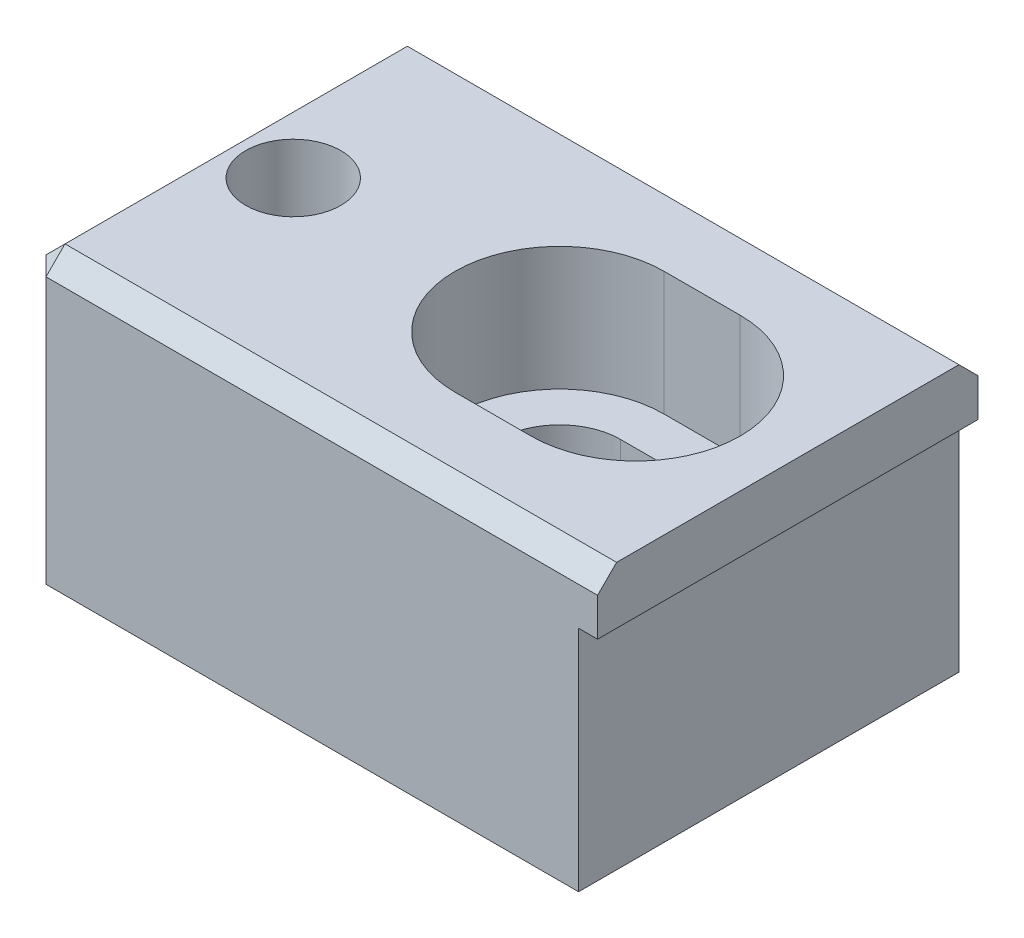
ISO-10303-21;
HEADER;
FILE_DESCRIPTION(('STEP AP214'),'2;1');
FILE_NAME('part.step','',(''),(''),'','','');
FILE_SCHEMA(('AUTOMOTIVE_DESIGN { 1 0 10303 214 1 1 1 1 }'));
ENDSEC;
DATA;
#1=APPLICATION_CONTEXT('core data for automotive mechanical design processes');
#2=APPLICATION_PROTOCOL_DEFINITION('international standard','automotive_design',2000,#1);
#3=PRODUCT_CONTEXT('',#1,'mechanical');
#4=PRODUCT('Part','Part','',(#3));
#5=PRODUCT_RELATED_PRODUCT_CATEGORY('part','',(#4));
#6=PRODUCT_DEFINITION_FORMATION('','',#4);
#7=PRODUCT_DEFINITION_CONTEXT('part definition',#1,'design');
#8=PRODUCT_DEFINITION('design','',#6,#7);
#9=PRODUCT_DEFINITION_SHAPE('','',#8);
#10=(LENGTH_UNIT() NAMED_UNIT(*) SI_UNIT(.MILLI.,.METRE.));
#11=(NAMED_UNIT(*) PLANE_ANGLE_UNIT() SI_UNIT($,.RADIAN.));
#12=(NAMED_UNIT(*) SI_UNIT($,.STERADIAN.) SOLID_ANGLE_UNIT());
#13=UNCERTAINTY_MEASURE_WITH_UNIT(LENGTH_MEASURE(1.E-05),#10,'distance_accuracy_value','');
#14=(GEOMETRIC_REPRESENTATION_CONTEXT(3) GLOBAL_UNCERTAINTY_ASSIGNED_CONTEXT((#13)) GLOBAL_UNIT_ASSIGNED_CONTEXT((#10,
#11,#12)) REPRESENTATION_CONTEXT('',''));
#15=CARTESIAN_POINT('',(0.,0.,0.));
#16=DIRECTION('',(0.,0.,1.));
#17=DIRECTION('',(1.,0.,0.));
#18=AXIS2_PLACEMENT_3D('',#15,#16,#17);
#19=CARTESIAN_POINT('',(-27.6,25.,10.));
#20=DIRECTION('',(1.,0.,0.));
#21=DIRECTION('',(0.,1.,0.));
#22=AXIS2_PLACEMENT_3D('',#19,#20,#21);
#23=PLANE('',#22);
#24=DIRECTION('',(0.,0.,-1.));
#25=VECTOR('',#24,1.);
#26=CARTESIAN_POINT('',(-27.6,10.,10.));
#27=LINE('',#26,#25);
#28=CARTESIAN_POINT('',(-27.6,10.,9.));
#29=VERTEX_POINT('',#28);
#30=CARTESIAN_POINT('',(-27.6,10.,-9.));
#31=VERTEX_POINT('',#30);
#32=EDGE_CURVE('E270',#29,#31,#27,.T.);
#33=ORIENTED_EDGE('',*,*,#32,.F.);
#34=DIRECTION('',(0.,1.,0.));
#35=VECTOR('',#34,1.);
#36=CARTESIAN_POINT('',(-27.6,25.,9.));
#37=LINE('',#36,#35);
#38=CARTESIAN_POINT('',(-27.6,24.,9.));
#39=VERTEX_POINT('',#38);
#40=EDGE_CURVE('E11',#29,#39,#37,.T.);
#41=ORIENTED_EDGE('',*,*,#40,.T.);
#42=DIRECTION('',(0.,0.,-1.));
#43=VECTOR('',#42,1.);
#44=CARTESIAN_POINT('',(-27.6,24.,10.));
#45=LINE('',#44,#43);
#46=CARTESIAN_POINT('',(-27.6,24.,-9.));
#47=VERTEX_POINT('',#46);
#48=EDGE_CURVE('E48',#39,#47,#45,.T.);
#49=ORIENTED_EDGE('',*,*,#48,.T.);
#50=DIRECTION('',(0.,-1.,0.));
#51=VECTOR('',#50,1.);
#52=CARTESIAN_POINT('',(-27.6,25.,-9.));
#53=LINE('',#52,#51);
#54=EDGE_CURVE('E296',#47,#31,#53,.T.);
#55=ORIENTED_EDGE('',*,*,#54,.T.);
#56=EDGE_LOOP('',(#33,#41,#49,#55));
#57=FACE_BOUND('',#56,.T.);
#58=ADVANCED_FACE('F39',(#57),#23,.F.);
#59=CARTESIAN_POINT('',(-27.6,10.,10.));
#60=DIRECTION('',(0.,1.,0.));
#61=DIRECTION('',(0.,0.,1.));
#62=AXIS2_PLACEMENT_3D('',#59,#60,#61);
#63=PLANE('',#62);
#64=DIRECTION('',(-1.,0.,0.));
#65=VECTOR('',#64,1.);
#66=CARTESIAN_POINT('',(-9.6,10.,-3.2));
#67=LINE('',#66,#65);
#68=CARTESIAN_POINT('',(-5.6,10.,-3.2));
#69=VERTEX_POINT('',#68);
#70=CARTESIAN_POINT('',(-9.6,10.,-3.2));
#71=VERTEX_POINT('',#70);
#72=EDGE_CURVE('E173',#69,#71,#67,.T.);
#73=ORIENTED_EDGE('',*,*,#72,.T.);
#74=CARTESIAN_POINT('',(-9.6,10.,0.));
#75=DIRECTION('',(0.,1.,0.));
#76=DIRECTION('',(0.,0.,1.));
#77=AXIS2_PLACEMENT_3D('',#74,#75,#76);
#78=CIRCLE('',#77,3.2);
#79=CARTESIAN_POINT('',(-9.6,10.,3.2));
#80=VERTEX_POINT('',#79);
#81=EDGE_CURVE('E167',#71,#80,#78,.T.);
#82=ORIENTED_EDGE('',*,*,#81,.T.);
#83=DIRECTION('',(1.,0.,0.));
#84=VECTOR('',#83,1.);
#85=CARTESIAN_POINT('',(-9.6,10.,3.2));
#86=LINE('',#85,#84);
#87=CARTESIAN_POINT('',(-5.6,10.,3.2));
#88=VERTEX_POINT('',#87);
#89=EDGE_CURVE('E176',#80,#88,#86,.T.);
#90=ORIENTED_EDGE('',*,*,#89,.T.);
#91=CARTESIAN_POINT('',(-5.6,10.,0.));
#92=DIRECTION('',(0.,1.,0.));
#93=DIRECTION('',(0.,0.,1.));
#94=AXIS2_PLACEMENT_3D('',#91,#92,#93);
#95=CIRCLE('',#94,3.2);
#96=EDGE_CURVE('E56',#88,#69,#95,.T.);
#97=ORIENTED_EDGE('',*,*,#96,.T.);
#98=EDGE_LOOP('',(#73,#82,#90,#97));
#99=FACE_BOUND('',#98,.T.);
#100=CARTESIAN_POINT('',(-23.6,10.,0.));
#101=DIRECTION('',(0.,1.,0.));
#102=DIRECTION('',(0.,0.,1.));
#103=AXIS2_PLACEMENT_3D('',#100,#101,#102);
#104=CIRCLE('',#103,2.5);
#105=CARTESIAN_POINT('',(-23.6,10.,2.5));
#106=VERTEX_POINT('',#105);
#107=EDGE_CURVE('E236',#106,#106,#104,.T.);
#108=ORIENTED_EDGE('',*,*,#107,.T.);
#109=EDGE_LOOP('',(#108));
#110=FACE_BOUND('',#109,.T.);
#111=DIRECTION('',(1.,0.,0.));
#112=VECTOR('',#111,1.);
#113=CARTESIAN_POINT('',(-27.6,10.,10.));
#114=LINE('',#113,#112);
#115=CARTESIAN_POINT('',(-26.6,10.,10.));
#116=VERTEX_POINT('',#115);
#117=CARTESIAN_POINT('',(1.4,10.,10.));
#118=VERTEX_POINT('',#117);
#119=EDGE_CURVE('E240',#116,#118,#114,.T.);
#120=ORIENTED_EDGE('',*,*,#119,.F.);
#121=DIRECTION('',(-0.707106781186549,0.,-0.707106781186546));
#122=VECTOR('',#121,1.);
#123=CARTESIAN_POINT('',(-26.6,10.,10.));
#124=LINE('',#123,#122);
#125=EDGE_CURVE('E294',#116,#29,#124,.T.);
#126=ORIENTED_EDGE('',*,*,#125,.T.);
#127=ORIENTED_EDGE('',*,*,#32,.T.);
#128=DIRECTION('',(-0.707106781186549,0.,0.707106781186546));
#129=VECTOR('',#128,1.);
#130=CARTESIAN_POINT('',(-27.6,10.,-9.));
#131=LINE('',#130,#129);
#132=CARTESIAN_POINT('',(-26.6,10.,-10.));
#133=VERTEX_POINT('',#132);
#134=EDGE_CURVE('E292',#31,#133,#131,.F.);
#135=ORIENTED_EDGE('',*,*,#134,.T.);
#136=DIRECTION('',(1.,0.,0.));
#137=VECTOR('',#136,1.);
#138=CARTESIAN_POINT('',(-27.6,10.,-10.));
#139=LINE('',#138,#137);
#140=CARTESIAN_POINT('',(1.4,10.,-10.));
#141=VERTEX_POINT('',#140);
#142=EDGE_CURVE('E251',#133,#141,#139,.T.);
#143=ORIENTED_EDGE('',*,*,#142,.T.);
#144=DIRECTION('',(0.,0.,-1.));
#145=VECTOR('',#144,1.);
#146=CARTESIAN_POINT('',(1.4,10.,10.));
#147=LINE('',#146,#145);
#148=EDGE_CURVE('E267',#118,#141,#147,.T.);
#149=ORIENTED_EDGE('',*,*,#148,.F.);
#150=EDGE_LOOP('',(#120,#126,#127,#135,#143,#149));
#151=FACE_BOUND('',#150,.T.);
#152=ADVANCED_FACE('F180',(#99,#110,#151),#63,.F.);
#153=CARTESIAN_POINT('',(1.4,22.,10.));
#154=DIRECTION('',(-1.,0.,0.));
#155=DIRECTION('',(0.,-1.,0.));
#156=AXIS2_PLACEMENT_3D('',#153,#154,#155);
#157=PLANE('',#156);
#158=DIRECTION('',(0.,1.,0.));
#159=VECTOR('',#158,1.);
#160=CARTESIAN_POINT('',(1.4,22.,-10.));
#161=LINE('',#160,#159);
#162=CARTESIAN_POINT('',(1.4,22.,-10.));
#163=VERTEX_POINT('',#162);
#164=EDGE_CURVE('E253',#141,#163,#161,.T.);
#165=ORIENTED_EDGE('',*,*,#164,.T.);
#166=DIRECTION('',(0.,0.,-1.));
#167=VECTOR('',#166,1.);
#168=CARTESIAN_POINT('',(1.4,22.,10.));
#169=LINE('',#168,#167);
#170=CARTESIAN_POINT('',(1.4,22.,10.));
#171=VERTEX_POINT('',#170);
#172=EDGE_CURVE('E264',#171,#163,#169,.T.);
#173=ORIENTED_EDGE('',*,*,#172,.F.);
#174=DIRECTION('',(0.,1.,0.));
#175=VECTOR('',#174,1.);
#176=CARTESIAN_POINT('',(1.4,22.,10.));
#177=LINE('',#176,#175);
#178=EDGE_CURVE('E242',#118,#171,#177,.T.);
#179=ORIENTED_EDGE('',*,*,#178,.F.);
#180=ORIENTED_EDGE('',*,*,#148,.T.);
#181=EDGE_LOOP('',(#165,#173,#179,#180));
#182=FACE_BOUND('',#181,.T.);
#183=ADVANCED_FACE('F349',(#182),#157,.F.);
#184=CARTESIAN_POINT('',(2.4,22.,10.));
#185=DIRECTION('',(0.,1.,0.));
#186=DIRECTION('',(0.,0.,1.));
#187=AXIS2_PLACEMENT_3D('',#184,#185,#186);
#188=PLANE('',#187);
#189=DIRECTION('',(1.,0.,0.));
#190=VECTOR('',#189,1.);
#191=CARTESIAN_POINT('',(2.4,22.,-10.));
#192=LINE('',#191,#190);
#193=CARTESIAN_POINT('',(2.4,22.,-10.));
#194=VERTEX_POINT('',#193);
#195=EDGE_CURVE('E255',#163,#194,#192,.T.);
#196=ORIENTED_EDGE('',*,*,#195,.T.);
#197=DIRECTION('',(0.,0.,-1.));
#198=VECTOR('',#197,1.);
#199=CARTESIAN_POINT('',(2.4,22.,10.));
#200=LINE('',#199,#198);
#201=CARTESIAN_POINT('',(2.4,22.,10.));
#202=VERTEX_POINT('',#201);
#203=EDGE_CURVE('E261',#202,#194,#200,.T.);
#204=ORIENTED_EDGE('',*,*,#203,.F.);
#205=DIRECTION('',(1.,0.,0.));
#206=VECTOR('',#205,1.);
#207=CARTESIAN_POINT('',(2.4,22.,10.));
#208=LINE('',#207,#206);
#209=EDGE_CURVE('E245',#171,#202,#208,.T.);
#210=ORIENTED_EDGE('',*,*,#209,.F.);
#211=ORIENTED_EDGE('',*,*,#172,.T.);
#212=EDGE_LOOP('',(#196,#204,#210,#211));
#213=FACE_BOUND('',#212,.T.);
#214=ADVANCED_FACE('F345',(#213),#188,.F.);
#215=CARTESIAN_POINT('',(2.4,25.,10.));
#216=DIRECTION('',(-1.,0.,0.));
#217=DIRECTION('',(0.,0.,1.));
#218=AXIS2_PLACEMENT_3D('',#215,#216,#217);
#219=PLANE('',#218);
#220=DIRECTION('',(0.,0.,-1.));
#221=VECTOR('',#220,1.);
#222=CARTESIAN_POINT('',(2.4,25.,10.));
#223=LINE('',#222,#221);
#224=CARTESIAN_POINT('',(2.4,25.,9.));
#225=VERTEX_POINT('',#224);
#226=CARTESIAN_POINT('',(2.4,25.,-9.));
#227=VERTEX_POINT('',#226);
#228=EDGE_CURVE('E250',#225,#227,#223,.T.);
#229=ORIENTED_EDGE('',*,*,#228,.F.);
#230=DIRECTION('',(0.,-0.707106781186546,0.707106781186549));
#231=VECTOR('',#230,1.);
#232=CARTESIAN_POINT('',(2.4,24.,10.));
#233=LINE('',#232,#231);
#234=CARTESIAN_POINT('',(2.4,24.,10.));
#235=VERTEX_POINT('',#234);
#236=EDGE_CURVE('E286',#225,#235,#233,.T.);
#237=ORIENTED_EDGE('',*,*,#236,.T.);
#238=DIRECTION('',(0.,1.,0.));
#239=VECTOR('',#238,1.);
#240=CARTESIAN_POINT('',(2.4,25.,10.));
#241=LINE('',#240,#239);
#242=EDGE_CURVE('E247',#202,#235,#241,.T.);
#243=ORIENTED_EDGE('',*,*,#242,.F.);
#244=ORIENTED_EDGE('',*,*,#203,.T.);
#245=DIRECTION('',(0.,1.,0.));
#246=VECTOR('',#245,1.);
#247=CARTESIAN_POINT('',(2.4,25.,-10.));
#248=LINE('',#247,#246);
#249=CARTESIAN_POINT('',(2.4,24.,-10.));
#250=VERTEX_POINT('',#249);
#251=EDGE_CURVE('E243',#194,#250,#248,.T.);
#252=ORIENTED_EDGE('',*,*,#251,.T.);
#253=DIRECTION('',(0.,-0.707106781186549,-0.707106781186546));
#254=VECTOR('',#253,1.);
#255=CARTESIAN_POINT('',(2.4,25.,-9.));
#256=LINE('',#255,#254);
#257=EDGE_CURVE('E284',#250,#227,#256,.F.);
#258=ORIENTED_EDGE('',*,*,#257,.T.);
#259=EDGE_LOOP('',(#229,#237,#243,#244,#252,#258));
#260=FACE_BOUND('',#259,.T.);
#261=ADVANCED_FACE('F340',(#260),#219,.F.);
#262=CARTESIAN_POINT('',(-27.6,25.,10.));
#263=DIRECTION('',(0.,-1.,0.));
#264=DIRECTION('',(0.,0.,-1.));
#265=AXIS2_PLACEMENT_3D('',#262,#263,#264);
#266=PLANE('',#265);
#267=DIRECTION('',(1.,0.,0.));
#268=VECTOR('',#267,1.);
#269=CARTESIAN_POINT('',(-9.6,25.,5.5));
#270=LINE('',#269,#268);
#271=CARTESIAN_POINT('',(-9.59999999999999,25.,5.5));
#272=VERTEX_POINT('',#271);
#273=CARTESIAN_POINT('',(-5.6,25.,5.5));
#274=VERTEX_POINT('',#273);
#275=EDGE_CURVE('E217',#272,#274,#270,.T.);
#276=ORIENTED_EDGE('',*,*,#275,.F.);
#277=CARTESIAN_POINT('',(-9.6,25.,0.));
#278=DIRECTION('',(0.,1.,0.));
#279=DIRECTION('',(0.,0.,1.));
#280=AXIS2_PLACEMENT_3D('',#277,#278,#279);
#281=CIRCLE('',#280,5.5);
#282=CARTESIAN_POINT('',(-9.6,25.,-5.5));
#283=VERTEX_POINT('',#282);
#284=EDGE_CURVE('E198',#283,#272,#281,.T.);
#285=ORIENTED_EDGE('',*,*,#284,.F.);
#286=DIRECTION('',(-1.,0.,0.));
#287=VECTOR('',#286,1.);
#288=CARTESIAN_POINT('',(-9.6,25.,-5.5));
#289=LINE('',#288,#287);
#290=CARTESIAN_POINT('',(-5.6,25.,-5.5));
#291=VERTEX_POINT('',#290);
#292=EDGE_CURVE('E206',#291,#283,#289,.T.);
#293=ORIENTED_EDGE('',*,*,#292,.F.);
#294=CARTESIAN_POINT('',(-5.6,25.,0.));
#295=DIRECTION('',(0.,1.,0.));
#296=DIRECTION('',(0.,0.,1.));
#297=AXIS2_PLACEMENT_3D('',#294,#295,#296);
#298=CIRCLE('',#297,5.5);
#299=EDGE_CURVE('E220',#274,#291,#298,.T.);
#300=ORIENTED_EDGE('',*,*,#299,.F.);
#301=EDGE_LOOP('',(#276,#285,#293,#300));
#302=FACE_BOUND('',#301,.T.);
#303=CARTESIAN_POINT('',(-23.6,25.,0.));
#304=DIRECTION('',(0.,1.,0.));
#305=DIRECTION('',(0.,0.,1.));
#306=AXIS2_PLACEMENT_3D('',#303,#304,#305);
#307=CIRCLE('',#306,2.49999999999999);
#308=CARTESIAN_POINT('',(-23.6,25.,2.49999999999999));
#309=VERTEX_POINT('',#308);
#310=EDGE_CURVE('E227',#309,#309,#307,.T.);
#311=ORIENTED_EDGE('',*,*,#310,.F.);
#312=EDGE_LOOP('',(#311));
#313=FACE_BOUND('',#312,.T.);
#314=DIRECTION('',(0.,0.,1.));
#315=VECTOR('',#314,1.);
#316=CARTESIAN_POINT('',(-26.6,25.,10.));
#317=LINE('',#316,#315);
#318=CARTESIAN_POINT('',(-26.6,25.,-9.));
#319=VERTEX_POINT('',#318);
#320=CARTESIAN_POINT('',(-26.6,25.,9.));
#321=VERTEX_POINT('',#320);
#322=EDGE_CURVE('E278',#319,#321,#317,.T.);
#323=ORIENTED_EDGE('',*,*,#322,.T.);
#324=DIRECTION('',(1.,0.,0.));
#325=VECTOR('',#324,1.);
#326=CARTESIAN_POINT('',(2.4,25.,9.));
#327=LINE('',#326,#325);
#328=EDGE_CURVE('E282',#321,#225,#327,.T.);
#329=ORIENTED_EDGE('',*,*,#328,.T.);
#330=ORIENTED_EDGE('',*,*,#228,.T.);
#331=DIRECTION('',(-1.,0.,0.));
#332=VECTOR('',#331,1.);
#333=CARTESIAN_POINT('',(-27.6,25.,-9.));
#334=LINE('',#333,#332);
#335=EDGE_CURVE('E280',#227,#319,#334,.T.);
#336=ORIENTED_EDGE('',*,*,#335,.T.);
#337=EDGE_LOOP('',(#323,#329,#330,#336));
#338=FACE_BOUND('',#337,.T.);
#339=ADVANCED_FACE('F327',(#302,#313,#338),#266,.F.);
#340=CARTESIAN_POINT('',(0.,0.,10.));
#341=DIRECTION('',(0.,0.,1.));
#342=DIRECTION('',(1.,0.,0.));
#343=AXIS2_PLACEMENT_3D('',#340,#341,#342);
#344=PLANE('',#343);
#345=ORIENTED_EDGE('',*,*,#242,.T.);
#346=DIRECTION('',(-1.,0.,0.));
#347=VECTOR('',#346,1.);
#348=CARTESIAN_POINT('',(-27.6,24.,10.));
#349=LINE('',#348,#347);
#350=CARTESIAN_POINT('',(-26.6,24.,10.));
#351=VERTEX_POINT('',#350);
#352=EDGE_CURVE('E275',#235,#351,#349,.T.);
#353=ORIENTED_EDGE('',*,*,#352,.T.);
#354=DIRECTION('',(0.,-1.,0.));
#355=VECTOR('',#354,1.);
#356=CARTESIAN_POINT('',(-26.6,10.,10.));
#357=LINE('',#356,#355);
#358=EDGE_CURVE('E273',#351,#116,#357,.T.);
#359=ORIENTED_EDGE('',*,*,#358,.T.);
#360=ORIENTED_EDGE('',*,*,#119,.T.);
#361=ORIENTED_EDGE('',*,*,#178,.T.);
#362=ORIENTED_EDGE('',*,*,#209,.T.);
#363=EDGE_LOOP('',(#345,#353,#359,#360,#361,#362));
#364=FACE_BOUND('',#363,.T.);
#365=ADVANCED_FACE('F370',(#364),#344,.T.);
#366=CARTESIAN_POINT('',(0.,0.,-10.));
#367=DIRECTION('',(0.,0.,1.));
#368=DIRECTION('',(1.,0.,0.));
#369=AXIS2_PLACEMENT_3D('',#366,#367,#368);
#370=PLANE('',#369);
#371=DIRECTION('',(0.,1.,0.));
#372=VECTOR('',#371,1.);
#373=CARTESIAN_POINT('',(-26.6,0.,-10.));
#374=LINE('',#373,#372);
#375=CARTESIAN_POINT('',(-26.6,24.,-10.));
#376=VERTEX_POINT('',#375);
#377=EDGE_CURVE('E288',#133,#376,#374,.T.);
#378=ORIENTED_EDGE('',*,*,#377,.T.);
#379=DIRECTION('',(1.,0.,0.));
#380=VECTOR('',#379,1.);
#381=CARTESIAN_POINT('',(0.,24.,-10.));
#382=LINE('',#381,#380);
#383=EDGE_CURVE('E290',#376,#250,#382,.T.);
#384=ORIENTED_EDGE('',*,*,#383,.T.);
#385=ORIENTED_EDGE('',*,*,#251,.F.);
#386=ORIENTED_EDGE('',*,*,#195,.F.);
#387=ORIENTED_EDGE('',*,*,#164,.F.);
#388=ORIENTED_EDGE('',*,*,#142,.F.);
#389=EDGE_LOOP('',(#378,#384,#385,#386,#387,#388));
#390=FACE_BOUND('',#389,.T.);
#391=ADVANCED_FACE('F336',(#390),#370,.F.);
#392=CARTESIAN_POINT('',(-27.6,25.,-9.));
#393=DIRECTION('',(0.707106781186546,0.,0.707106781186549));
#394=DIRECTION('',(0.,-1.,0.));
#395=AXIS2_PLACEMENT_3D('',#392,#393,#394);
#396=PLANE('',#395);
#397=ORIENTED_EDGE('',*,*,#134,.F.);
#398=ORIENTED_EDGE('',*,*,#54,.F.);
#399=DIRECTION('',(0.707106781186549,0.,-0.707106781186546));
#400=VECTOR('',#399,1.);
#401=CARTESIAN_POINT('',(-27.1,24.,-9.5));
#402=LINE('',#401,#400);
#403=EDGE_CURVE('E43',#376,#47,#402,.F.);
#404=ORIENTED_EDGE('',*,*,#403,.F.);
#405=ORIENTED_EDGE('',*,*,#377,.F.);
#406=EDGE_LOOP('',(#397,#398,#404,#405));
#407=FACE_BOUND('',#406,.T.);
#408=ADVANCED_FACE('F41',(#407),#396,.F.);
#409=CARTESIAN_POINT('',(-27.6,25.,-9.));
#410=DIRECTION('',(0.,-0.707106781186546,0.707106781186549));
#411=DIRECTION('',(-1.,0.,0.));
#412=AXIS2_PLACEMENT_3D('',#409,#410,#411);
#413=PLANE('',#412);
#414=ORIENTED_EDGE('',*,*,#257,.F.);
#415=ORIENTED_EDGE('',*,*,#383,.F.);
#416=DIRECTION('',(0.,0.707106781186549,0.707106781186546));
#417=VECTOR('',#416,1.);
#418=CARTESIAN_POINT('',(-26.6,25.,-9.));
#419=LINE('',#418,#417);
#420=EDGE_CURVE('E308',#319,#376,#419,.F.);
#421=ORIENTED_EDGE('',*,*,#420,.F.);
#422=ORIENTED_EDGE('',*,*,#335,.F.);
#423=EDGE_LOOP('',(#414,#415,#421,#422));
#424=FACE_BOUND('',#423,.T.);
#425=ADVANCED_FACE('F333',(#424),#413,.F.);
#426=CARTESIAN_POINT('',(-26.6,25.,-9.));
#427=DIRECTION('',(-0.577350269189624,0.577350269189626,-0.577350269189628));
#428=DIRECTION('',(0.,0.707106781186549,0.707106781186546));
#429=AXIS2_PLACEMENT_3D('',#426,#427,#428);
#430=PLANE('',#429);
#431=ORIENTED_EDGE('',*,*,#420,.T.);
#432=ORIENTED_EDGE('',*,*,#403,.T.);
#433=DIRECTION('',(-0.707106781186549,-0.707106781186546,0.));
#434=VECTOR('',#433,1.);
#435=CARTESIAN_POINT('',(-26.6,25.,-9.));
#436=LINE('',#435,#434);
#437=EDGE_CURVE('E306',#319,#47,#436,.T.);
#438=ORIENTED_EDGE('',*,*,#437,.F.);
#439=EDGE_LOOP('',(#431,#432,#438));
#440=FACE_BOUND('',#439,.T.);
#441=ADVANCED_FACE('F315',(#440),#430,.T.);
#442=CARTESIAN_POINT('',(-26.6,0.,10.));
#443=DIRECTION('',(-0.707106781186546,0.,0.707106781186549));
#444=DIRECTION('',(0.,1.,0.));
#445=AXIS2_PLACEMENT_3D('',#442,#443,#444);
#446=PLANE('',#445);
#447=ORIENTED_EDGE('',*,*,#125,.F.);
#448=ORIENTED_EDGE('',*,*,#358,.F.);
#449=DIRECTION('',(0.707106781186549,0.,0.707106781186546));
#450=VECTOR('',#449,1.);
#451=CARTESIAN_POINT('',(-26.6,24.,10.));
#452=LINE('',#451,#450);
#453=EDGE_CURVE('E303',#39,#351,#452,.T.);
#454=ORIENTED_EDGE('',*,*,#453,.F.);
#455=ORIENTED_EDGE('',*,*,#40,.F.);
#456=EDGE_LOOP('',(#447,#448,#454,#455));
#457=FACE_BOUND('',#456,.T.);
#458=ADVANCED_FACE('F360',(#457),#446,.T.);
#459=CARTESIAN_POINT('',(-27.6,24.,10.));
#460=DIRECTION('',(0.707106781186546,-0.707106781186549,0.));
#461=DIRECTION('',(0.,0.,-1.));
#462=AXIS2_PLACEMENT_3D('',#459,#460,#461);
#463=PLANE('',#462);
#464=ORIENTED_EDGE('',*,*,#437,.T.);
#465=ORIENTED_EDGE('',*,*,#48,.F.);
#466=DIRECTION('',(0.707106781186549,0.707106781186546,0.));
#467=VECTOR('',#466,1.);
#468=CARTESIAN_POINT('',(-27.1,24.5,9.));
#469=LINE('',#468,#467);
#470=EDGE_CURVE('E300',#321,#39,#469,.F.);
#471=ORIENTED_EDGE('',*,*,#470,.F.);
#472=ORIENTED_EDGE('',*,*,#322,.F.);
#473=EDGE_LOOP('',(#464,#465,#471,#472));
#474=FACE_BOUND('',#473,.T.);
#475=ADVANCED_FACE('F322',(#474),#463,.F.);
#476=CARTESIAN_POINT('',(-26.6,24.,10.));
#477=DIRECTION('',(-0.577350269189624,0.577350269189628,0.577350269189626));
#478=DIRECTION('',(0.,-0.707106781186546,0.707106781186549));
#479=AXIS2_PLACEMENT_3D('',#476,#477,#478);
#480=PLANE('',#479);
#481=ORIENTED_EDGE('',*,*,#470,.T.);
#482=ORIENTED_EDGE('',*,*,#453,.T.);
#483=DIRECTION('',(0.,0.707106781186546,-0.707106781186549));
#484=VECTOR('',#483,1.);
#485=CARTESIAN_POINT('',(-26.6,24.,10.));
#486=LINE('',#485,#484);
#487=EDGE_CURVE('E239',#321,#351,#486,.F.);
#488=ORIENTED_EDGE('',*,*,#487,.F.);
#489=EDGE_LOOP('',(#481,#482,#488));
#490=FACE_BOUND('',#489,.T.);
#491=ADVANCED_FACE('F364',(#490),#480,.T.);
#492=CARTESIAN_POINT('',(0.,24.,10.));
#493=DIRECTION('',(0.,0.707106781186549,0.707106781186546));
#494=DIRECTION('',(1.,0.,0.));
#495=AXIS2_PLACEMENT_3D('',#492,#493,#494);
#496=PLANE('',#495);
#497=ORIENTED_EDGE('',*,*,#236,.F.);
#498=ORIENTED_EDGE('',*,*,#328,.F.);
#499=ORIENTED_EDGE('',*,*,#487,.T.);
#500=ORIENTED_EDGE('',*,*,#352,.F.);
#501=EDGE_LOOP('',(#497,#498,#499,#500));
#502=FACE_BOUND('',#501,.T.);
#503=ADVANCED_FACE('F368',(#502),#496,.T.);
#504=CARTESIAN_POINT('',(-23.6,25.,0.));
#505=DIRECTION('',(0.,1.,0.));
#506=DIRECTION('',(0.,0.,1.));
#507=AXIS2_PLACEMENT_3D('',#504,#505,#506);
#508=CYLINDRICAL_SURFACE('',#507,2.49999999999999);
#509=ORIENTED_EDGE('',*,*,#107,.F.);
#510=EDGE_LOOP('',(#509));
#511=FACE_BOUND('',#510,.T.);
#512=ORIENTED_EDGE('',*,*,#310,.T.);
#513=EDGE_LOOP('',(#512));
#514=FACE_BOUND('',#513,.T.);
#515=ADVANCED_FACE('F391',(#511,#514),#508,.F.);
#516=CARTESIAN_POINT('',(-9.6,18.5,0.));
#517=DIRECTION('',(0.,1.,0.));
#518=DIRECTION('',(0.,0.,1.));
#519=AXIS2_PLACEMENT_3D('',#516,#517,#518);
#520=CYLINDRICAL_SURFACE('',#519,5.5);
#521=ORIENTED_EDGE('',*,*,#284,.T.);
#522=DIRECTION('',(0.,1.,0.));
#523=VECTOR('',#522,1.);
#524=CARTESIAN_POINT('',(-9.6,18.5,5.5));
#525=LINE('',#524,#523);
#526=CARTESIAN_POINT('',(-9.6,18.5,5.5));
#527=VERTEX_POINT('',#526);
#528=EDGE_CURVE('E215',#527,#272,#525,.T.);
#529=ORIENTED_EDGE('',*,*,#528,.F.);
#530=CARTESIAN_POINT('',(-9.6,18.5,0.));
#531=DIRECTION('',(0.,1.,0.));
#532=DIRECTION('',(0.,0.,1.));
#533=AXIS2_PLACEMENT_3D('',#530,#531,#532);
#534=CIRCLE('',#533,5.5);
#535=CARTESIAN_POINT('',(-9.6,18.5,-5.5));
#536=VERTEX_POINT('',#535);
#537=EDGE_CURVE('E202',#536,#527,#534,.T.);
#538=ORIENTED_EDGE('',*,*,#537,.F.);
#539=DIRECTION('',(0.,1.,0.));
#540=VECTOR('',#539,1.);
#541=CARTESIAN_POINT('',(-9.6,18.5,-5.5));
#542=LINE('',#541,#540);
#543=EDGE_CURVE('E225',#536,#283,#542,.T.);
#544=ORIENTED_EDGE('',*,*,#543,.T.);
#545=EDGE_LOOP('',(#521,#529,#538,#544));
#546=FACE_BOUND('',#545,.T.);
#547=ADVANCED_FACE('F507',(#546),#520,.F.);
#548=CARTESIAN_POINT('',(-9.6,18.5,-5.5));
#549=DIRECTION('',(0.,0.,-1.));
#550=DIRECTION('',(-1.,0.,0.));
#551=AXIS2_PLACEMENT_3D('',#548,#549,#550);
#552=PLANE('',#551);
#553=ORIENTED_EDGE('',*,*,#292,.T.);
#554=ORIENTED_EDGE('',*,*,#543,.F.);
#555=DIRECTION('',(-1.,0.,0.));
#556=VECTOR('',#555,1.);
#557=CARTESIAN_POINT('',(-9.6,18.5,-5.5));
#558=LINE('',#557,#556);
#559=CARTESIAN_POINT('',(-5.6,18.5,-5.5));
#560=VERTEX_POINT('',#559);
#561=EDGE_CURVE('E212',#560,#536,#558,.T.);
#562=ORIENTED_EDGE('',*,*,#561,.F.);
#563=DIRECTION('',(0.,1.,0.));
#564=VECTOR('',#563,1.);
#565=CARTESIAN_POINT('',(-5.6,18.5,-5.5));
#566=LINE('',#565,#564);
#567=EDGE_CURVE('E228',#560,#291,#566,.T.);
#568=ORIENTED_EDGE('',*,*,#567,.T.);
#569=EDGE_LOOP('',(#553,#554,#562,#568));
#570=FACE_BOUND('',#569,.T.);
#571=ADVANCED_FACE('F503',(#570),#552,.F.);
#572=CARTESIAN_POINT('',(-5.6,18.5,0.));
#573=DIRECTION('',(0.,1.,0.));
#574=DIRECTION('',(0.,0.,1.));
#575=AXIS2_PLACEMENT_3D('',#572,#573,#574);
#576=CYLINDRICAL_SURFACE('',#575,5.5);
#577=ORIENTED_EDGE('',*,*,#299,.T.);
#578=ORIENTED_EDGE('',*,*,#567,.F.);
#579=CARTESIAN_POINT('',(-5.6,18.5,0.));
#580=DIRECTION('',(0.,1.,0.));
#581=DIRECTION('',(0.,0.,1.));
#582=AXIS2_PLACEMENT_3D('',#579,#580,#581);
#583=CIRCLE('',#582,5.5);
#584=CARTESIAN_POINT('',(-5.6,18.5,5.5));
#585=VERTEX_POINT('',#584);
#586=EDGE_CURVE('E209',#585,#560,#583,.T.);
#587=ORIENTED_EDGE('',*,*,#586,.F.);
#588=DIRECTION('',(0.,1.,0.));
#589=VECTOR('',#588,1.);
#590=CARTESIAN_POINT('',(-5.6,18.5,5.5));
#591=LINE('',#590,#589);
#592=EDGE_CURVE('E230',#585,#274,#591,.T.);
#593=ORIENTED_EDGE('',*,*,#592,.T.);
#594=EDGE_LOOP('',(#577,#578,#587,#593));
#595=FACE_BOUND('',#594,.T.);
#596=ADVANCED_FACE('F506',(#595),#576,.F.);
#597=CARTESIAN_POINT('',(-9.6,18.5,5.5));
#598=DIRECTION('',(0.,0.,1.));
#599=DIRECTION('',(1.,0.,0.));
#600=AXIS2_PLACEMENT_3D('',#597,#598,#599);
#601=PLANE('',#600);
#602=ORIENTED_EDGE('',*,*,#275,.T.);
#603=ORIENTED_EDGE('',*,*,#592,.F.);
#604=DIRECTION('',(1.,0.,0.));
#605=VECTOR('',#604,1.);
#606=CARTESIAN_POINT('',(-9.6,18.5,5.5));
#607=LINE('',#606,#605);
#608=EDGE_CURVE('E205',#527,#585,#607,.T.);
#609=ORIENTED_EDGE('',*,*,#608,.F.);
#610=ORIENTED_EDGE('',*,*,#528,.T.);
#611=EDGE_LOOP('',(#602,#603,#609,#610));
#612=FACE_BOUND('',#611,.T.);
#613=ADVANCED_FACE('F453',(#612),#601,.F.);
#614=CARTESIAN_POINT('',(-9.6,18.5,0.));
#615=DIRECTION('',(0.,1.,0.));
#616=DIRECTION('',(0.,0.,1.));
#617=AXIS2_PLACEMENT_3D('',#614,#615,#616);
#618=PLANE('',#617);
#619=CARTESIAN_POINT('',(-9.6,18.5,0.));
#620=DIRECTION('',(0.,1.,0.));
#621=DIRECTION('',(0.,0.,1.));
#622=AXIS2_PLACEMENT_3D('',#619,#620,#621);
#623=CIRCLE('',#622,3.2);
#624=CARTESIAN_POINT('',(-9.6,18.5,-3.2));
#625=VERTEX_POINT('',#624);
#626=CARTESIAN_POINT('',(-9.6,18.5,3.2));
#627=VERTEX_POINT('',#626);
#628=EDGE_CURVE('E64',#625,#627,#623,.T.);
#629=ORIENTED_EDGE('',*,*,#628,.F.);
#630=DIRECTION('',(-1.,0.,0.));
#631=VECTOR('',#630,1.);
#632=CARTESIAN_POINT('',(-9.6,18.5,-3.2));
#633=LINE('',#632,#631);
#634=CARTESIAN_POINT('',(-5.6,18.5,-3.2));
#635=VERTEX_POINT('',#634);
#636=EDGE_CURVE('E183',#635,#625,#633,.T.);
#637=ORIENTED_EDGE('',*,*,#636,.F.);
#638=CARTESIAN_POINT('',(-5.6,18.5,0.));
#639=DIRECTION('',(0.,1.,0.));
#640=DIRECTION('',(0.,0.,1.));
#641=AXIS2_PLACEMENT_3D('',#638,#639,#640);
#642=CIRCLE('',#641,3.2);
#643=CARTESIAN_POINT('',(-5.6,18.5,3.2));
#644=VERTEX_POINT('',#643);
#645=EDGE_CURVE('E186',#644,#635,#642,.T.);
#646=ORIENTED_EDGE('',*,*,#645,.F.);
#647=DIRECTION('',(1.,0.,0.));
#648=VECTOR('',#647,1.);
#649=CARTESIAN_POINT('',(-9.6,18.5,3.2));
#650=LINE('',#649,#648);
#651=EDGE_CURVE('E192',#627,#644,#650,.T.);
#652=ORIENTED_EDGE('',*,*,#651,.F.);
#653=EDGE_LOOP('',(#629,#637,#646,#652));
#654=FACE_BOUND('',#653,.T.);
#655=ORIENTED_EDGE('',*,*,#537,.T.);
#656=ORIENTED_EDGE('',*,*,#608,.T.);
#657=ORIENTED_EDGE('',*,*,#586,.T.);
#658=ORIENTED_EDGE('',*,*,#561,.T.);
#659=EDGE_LOOP('',(#655,#656,#657,#658));
#660=FACE_BOUND('',#659,.T.);
#661=ADVANCED_FACE('F458',(#654,#660),#618,.T.);
#662=CARTESIAN_POINT('',(-9.6,10.,0.));
#663=DIRECTION('',(0.,1.,0.));
#664=DIRECTION('',(0.,0.,1.));
#665=AXIS2_PLACEMENT_3D('',#662,#663,#664);
#666=CYLINDRICAL_SURFACE('',#665,3.2);
#667=ORIENTED_EDGE('',*,*,#628,.T.);
#668=DIRECTION('',(0.,1.,0.));
#669=VECTOR('',#668,1.);
#670=CARTESIAN_POINT('',(-9.6,10.,3.2));
#671=LINE('',#670,#669);
#672=EDGE_CURVE('E163',#80,#627,#671,.T.);
#673=ORIENTED_EDGE('',*,*,#672,.F.);
#674=ORIENTED_EDGE('',*,*,#81,.F.);
#675=DIRECTION('',(0.,1.,0.));
#676=VECTOR('',#675,1.);
#677=CARTESIAN_POINT('',(-9.6,10.,-3.2));
#678=LINE('',#677,#676);
#679=EDGE_CURVE('E196',#71,#625,#678,.T.);
#680=ORIENTED_EDGE('',*,*,#679,.T.);
#681=EDGE_LOOP('',(#667,#673,#674,#680));
#682=FACE_BOUND('',#681,.T.);
#683=ADVANCED_FACE('F165',(#682),#666,.F.);
#684=CARTESIAN_POINT('',(-9.6,10.,-3.2));
#685=DIRECTION('',(0.,0.,-1.));
#686=DIRECTION('',(-1.,0.,0.));
#687=AXIS2_PLACEMENT_3D('',#684,#685,#686);
#688=PLANE('',#687);
#689=ORIENTED_EDGE('',*,*,#636,.T.);
#690=ORIENTED_EDGE('',*,*,#679,.F.);
#691=ORIENTED_EDGE('',*,*,#72,.F.);
#692=DIRECTION('',(0.,1.,0.));
#693=VECTOR('',#692,1.);
#694=CARTESIAN_POINT('',(-5.6,10.,-3.2));
#695=LINE('',#694,#693);
#696=EDGE_CURVE('E199',#69,#635,#695,.T.);
#697=ORIENTED_EDGE('',*,*,#696,.T.);
#698=EDGE_LOOP('',(#689,#690,#691,#697));
#699=FACE_BOUND('',#698,.T.);
#700=ADVANCED_FACE('F472',(#699),#688,.F.);
#701=CARTESIAN_POINT('',(-5.6,10.,0.));
#702=DIRECTION('',(0.,1.,0.));
#703=DIRECTION('',(0.,0.,1.));
#704=AXIS2_PLACEMENT_3D('',#701,#702,#703);
#705=CYLINDRICAL_SURFACE('',#704,3.2);
#706=ORIENTED_EDGE('',*,*,#645,.T.);
#707=ORIENTED_EDGE('',*,*,#696,.F.);
#708=ORIENTED_EDGE('',*,*,#96,.F.);
#709=DIRECTION('',(0.,1.,0.));
#710=VECTOR('',#709,1.);
#711=CARTESIAN_POINT('',(-5.6,10.,3.2));
#712=LINE('',#711,#710);
#713=EDGE_CURVE('E172',#88,#644,#712,.T.);
#714=ORIENTED_EDGE('',*,*,#713,.T.);
#715=EDGE_LOOP('',(#706,#707,#708,#714));
#716=FACE_BOUND('',#715,.T.);
#717=ADVANCED_FACE('F481',(#716),#705,.F.);
#718=CARTESIAN_POINT('',(-9.6,10.,3.2));
#719=DIRECTION('',(0.,0.,1.));
#720=DIRECTION('',(1.,0.,0.));
#721=AXIS2_PLACEMENT_3D('',#718,#719,#720);
#722=PLANE('',#721);
#723=ORIENTED_EDGE('',*,*,#651,.T.);
#724=ORIENTED_EDGE('',*,*,#713,.F.);
#725=ORIENTED_EDGE('',*,*,#89,.F.);
#726=ORIENTED_EDGE('',*,*,#672,.T.);
#727=EDGE_LOOP('',(#723,#724,#725,#726));
#728=FACE_BOUND('',#727,.T.);
#729=ADVANCED_FACE('F177',(#728),#722,.F.);
#730=CLOSED_SHELL('',(#58,#152,#183,#214,#261,#339,#365,#391,#408,#425,#441,#458,#475,#491,#503,
#515,#547,#571,#596,#613,#661,#683,#700,#717,#729));
#731=MANIFOLD_SOLID_BREP('B2',#730);
#732=ADVANCED_BREP_SHAPE_REPRESENTATION('',(#18,#731),#14);
#733=SHAPE_DEFINITION_REPRESENTATION(#9,#732);
ENDSEC;
END-ISO-10303-21;
